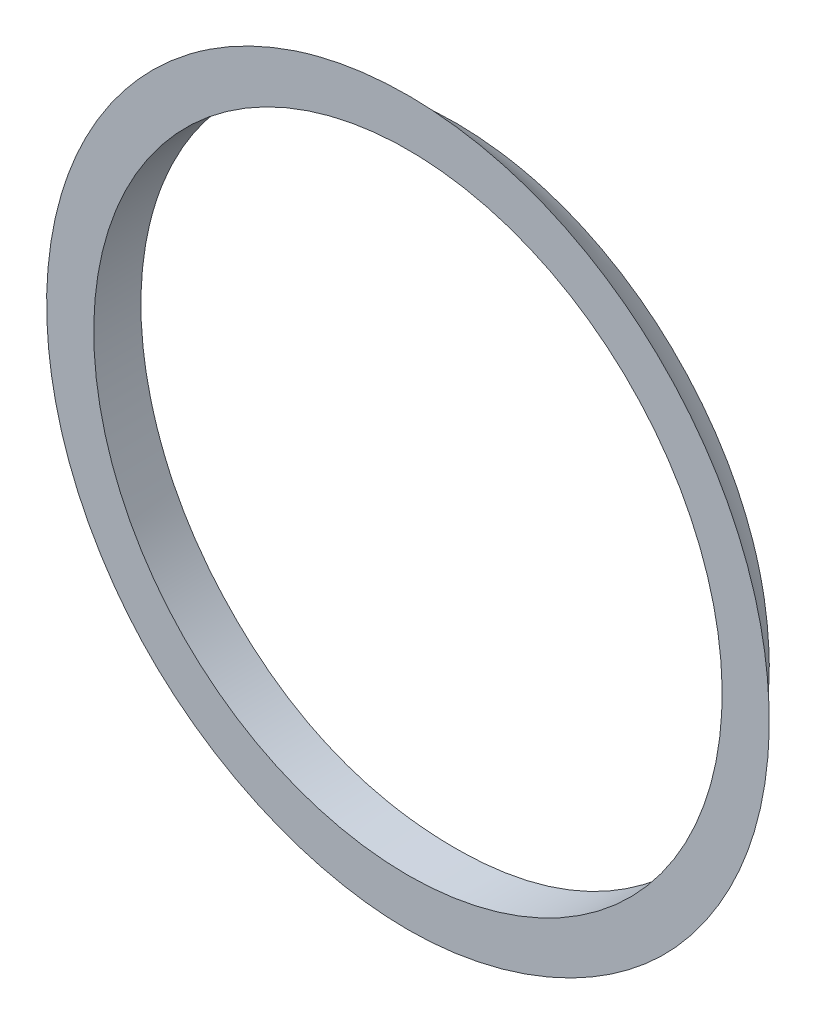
ISO-10303-21;
HEADER;
FILE_DESCRIPTION(('STEP AP214'),'2;1');
FILE_NAME('part.step','',(''),(''),'','','');
FILE_SCHEMA(('AUTOMOTIVE_DESIGN { 1 0 10303 214 1 1 1 1 }'));
ENDSEC;
DATA;
#1=APPLICATION_CONTEXT('core data for automotive mechanical design processes');
#2=APPLICATION_PROTOCOL_DEFINITION('international standard','automotive_design',2000,#1);
#3=PRODUCT_CONTEXT('',#1,'mechanical');
#4=PRODUCT('Part','Part','',(#3));
#5=PRODUCT_RELATED_PRODUCT_CATEGORY('part','',(#4));
#6=PRODUCT_DEFINITION_FORMATION('','',#4);
#7=PRODUCT_DEFINITION_CONTEXT('part definition',#1,'design');
#8=PRODUCT_DEFINITION('design','',#6,#7);
#9=PRODUCT_DEFINITION_SHAPE('','',#8);
#10=(LENGTH_UNIT() NAMED_UNIT(*) SI_UNIT(.MILLI.,.METRE.));
#11=(NAMED_UNIT(*) PLANE_ANGLE_UNIT() SI_UNIT($,.RADIAN.));
#12=(NAMED_UNIT(*) SI_UNIT($,.STERADIAN.) SOLID_ANGLE_UNIT());
#13=UNCERTAINTY_MEASURE_WITH_UNIT(LENGTH_MEASURE(1.E-05),#10,'distance_accuracy_value','');
#14=(GEOMETRIC_REPRESENTATION_CONTEXT(3) GLOBAL_UNCERTAINTY_ASSIGNED_CONTEXT((#13)) GLOBAL_UNIT_ASSIGNED_CONTEXT((#10,
#11,#12)) REPRESENTATION_CONTEXT('',''));
#15=CARTESIAN_POINT('',(0.,0.,0.));
#16=DIRECTION('',(0.,0.,1.));
#17=DIRECTION('',(1.,0.,0.));
#18=AXIS2_PLACEMENT_3D('',#15,#16,#17);
#19=CARTESIAN_POINT('',(718.031944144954,689.142048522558,-152.499999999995));
#20=DIRECTION('',(0.,0.,0.999999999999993));
#21=DIRECTION('',(0.0973225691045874,0.995252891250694,0.));
#22=AXIS2_PLACEMENT_3D('',#19,#20,#21);
#23=CYLINDRICAL_SURFACE('',#22,20.);
#24=CARTESIAN_POINT('',(718.031944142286,669.142048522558,-150.499999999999));
#25=CARTESIAN_POINT('',(717.47101142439,669.142052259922,-150.500001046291));
#26=CARTESIAN_POINT('',(716.909974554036,669.165667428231,-150.496684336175));
#27=CARTESIAN_POINT('',(715.791804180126,669.259977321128,-150.486761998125));
#28=CARTESIAN_POINT('',(715.234671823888,669.330685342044,-150.480155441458));
#29=CARTESIAN_POINT('',(714.127708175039,669.518784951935,-150.466517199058));
#30=CARTESIAN_POINT('',(713.577885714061,669.636228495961,-150.459485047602));
#31=CARTESIAN_POINT('',(712.490054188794,669.916989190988,-150.447181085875));
#32=CARTESIAN_POINT('',(711.952044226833,670.080302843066,-150.441909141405));
#33=CARTESIAN_POINT('',(711.068347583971,670.389748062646,-150.435716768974));
#34=CARTESIAN_POINT('',(710.71827380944,670.523493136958,-150.433931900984));
#35=CARTESIAN_POINT('',(710.026156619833,670.81044543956,-150.431934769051));
#36=CARTESIAN_POINT('',(709.684113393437,670.963653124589,-150.43172254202));
#37=CARTESIAN_POINT('',(709.009181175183,671.289034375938,-150.432906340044));
#38=CARTESIAN_POINT('',(708.676292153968,671.461207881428,-150.43430235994));
#39=CARTESIAN_POINT('',(708.020786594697,671.82393649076,-150.438559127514));
#40=CARTESIAN_POINT('',(707.698167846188,672.014487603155,-150.441419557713));
#41=CARTESIAN_POINT('',(707.064147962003,672.413398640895,-150.448283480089));
#42=CARTESIAN_POINT('',(706.752746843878,672.621758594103,-150.452286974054));
#43=CARTESIAN_POINT('',(706.142139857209,673.055631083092,-150.46092886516));
#44=CARTESIAN_POINT('',(705.842934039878,673.281143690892,-150.465567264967));
#45=CARTESIAN_POINT('',(705.257897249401,673.74842111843,-150.474774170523));
#46=CARTESIAN_POINT('',(704.972055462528,673.990172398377,-150.479342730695));
#47=CARTESIAN_POINT('',(704.414378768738,674.489336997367,-150.487525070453));
#48=CARTESIAN_POINT('',(704.142543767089,674.746750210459,-150.491138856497));
#49=CARTESIAN_POINT('',(703.613736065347,675.276432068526,-150.496329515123));
#50=CARTESIAN_POINT('',(703.356763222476,675.548700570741,-150.497906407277));
#51=CARTESIAN_POINT('',(702.858494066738,676.107230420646,-150.499570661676));
#52=CARTESIAN_POINT('',(702.617198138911,676.39349211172,-150.49965798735));
#53=CARTESIAN_POINT('',(702.151034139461,676.979123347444,-150.499146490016));
#54=CARTESIAN_POINT('',(701.926166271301,677.278493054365,-150.498547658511));
#55=CARTESIAN_POINT('',(701.6017514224,677.736620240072,-150.497900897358));
#56=CARTESIAN_POINT('',(701.495757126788,677.890847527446,-150.49772722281));
#57=CARTESIAN_POINT('',(701.288135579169,678.202217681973,-150.497582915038));
#58=CARTESIAN_POINT('',(701.186508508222,678.359360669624,-150.497612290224));
#59=CARTESIAN_POINT('',(700.788682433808,678.9938760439,-150.498076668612));
#60=CARTESIAN_POINT('',(700.510240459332,679.482564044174,-150.499205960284));
#61=CARTESIAN_POINT('',(699.995511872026,680.481626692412,-150.502113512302));
#62=CARTESIAN_POINT('',(699.759225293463,680.992001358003,-150.503891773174));
#63=CARTESIAN_POINT('',(699.437676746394,681.771010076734,-150.50601073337));
#64=CARTESIAN_POINT('',(699.335964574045,682.032950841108,-150.506625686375));
#65=CARTESIAN_POINT('',(699.143661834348,682.560884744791,-150.50753036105));
#66=CARTESIAN_POINT('',(699.053071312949,682.826877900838,-150.507820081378));
#67=CARTESIAN_POINT('',(698.798248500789,683.630200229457,-150.50808594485));
#68=CARTESIAN_POINT('',(698.650916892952,684.172988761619,-150.507459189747));
#69=CARTESIAN_POINT('',(698.402412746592,685.269371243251,-150.505003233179));
#70=CARTESIAN_POINT('',(698.301267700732,685.82297142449,-150.503173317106));
#71=CARTESIAN_POINT('',(698.184794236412,686.658152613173,-150.501275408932));
#72=CARTESIAN_POINT('',(698.15184206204,686.937374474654,-150.500783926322));
#73=CARTESIAN_POINT('',(698.097734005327,687.49697683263,-150.500125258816));
#74=CARTESIAN_POINT('',(698.076578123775,687.777357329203,-150.49995807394));
#75=CARTESIAN_POINT('',(698.046105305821,688.338755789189,-150.499869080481));
#76=CARTESIAN_POINT('',(698.036788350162,688.619773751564,-150.499947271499));
#77=CARTESIAN_POINT('',(698.030008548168,689.181953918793,-150.499998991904));
#78=CARTESIAN_POINT('',(698.032545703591,689.463116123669,-150.499972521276));
#79=CARTESIAN_POINT('',(698.049469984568,690.025083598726,-150.49996992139));
#80=CARTESIAN_POINT('',(698.063857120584,690.305888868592,-150.499993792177));
#81=CARTESIAN_POINT('',(698.104455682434,690.866643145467,-150.500332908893));
#82=CARTESIAN_POINT('',(698.130667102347,691.146592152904,-150.500648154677));
#83=CARTESIAN_POINT('',(698.194868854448,691.705146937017,-150.501581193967));
#84=CARTESIAN_POINT('',(698.232859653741,691.98375265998,-150.502198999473));
#85=CARTESIAN_POINT('',(698.320552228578,692.53911462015,-150.503601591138));
#86=CARTESIAN_POINT('',(698.3702540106,692.815870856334,-150.50438637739));
#87=CARTESIAN_POINT('',(698.481280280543,693.367042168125,-150.505759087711));
#88=CARTESIAN_POINT('',(698.542604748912,693.64145724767,-150.506347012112));
#89=CARTESIAN_POINT('',(698.676767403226,694.187458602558,-150.507186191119));
#90=CARTESIAN_POINT('',(698.749605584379,694.459044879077,-150.507437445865));
#91=CARTESIAN_POINT('',(698.906666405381,694.998906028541,-150.507588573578));
#92=CARTESIAN_POINT('',(698.990889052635,695.267180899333,-150.507488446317));
#93=CARTESIAN_POINT('',(699.170568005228,695.799940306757,-150.50698581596));
#94=CARTESIAN_POINT('',(699.266024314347,696.064424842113,-150.506583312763));
#95=CARTESIAN_POINT('',(699.468004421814,696.589139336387,-150.505615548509));
#96=CARTESIAN_POINT('',(699.574528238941,696.849369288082,-150.505050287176));
#97=CARTESIAN_POINT('',(699.798441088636,697.365090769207,-150.503920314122));
#98=CARTESIAN_POINT('',(699.915830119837,697.620582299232,-150.5033556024));
#99=CARTESIAN_POINT('',(700.284000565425,698.379275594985,-150.50169535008));
#100=CARTESIAN_POINT('',(700.550829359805,698.874810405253,-150.500633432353));
#101=CARTESIAN_POINT('',(701.125246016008,699.841572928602,-150.498634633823));
#102=CARTESIAN_POINT('',(701.432833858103,700.312800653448,-150.497697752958));
#103=CARTESIAN_POINT('',(702.086620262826,701.22768916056,-150.495925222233));
#104=CARTESIAN_POINT('',(702.432818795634,701.671349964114,-150.495089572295));
#105=CARTESIAN_POINT('',(703.161356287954,702.527927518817,-150.493922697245));
#106=CARTESIAN_POINT('',(703.543695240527,702.940844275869,-150.493591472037));
#107=CARTESIAN_POINT('',(704.341813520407,703.733020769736,-150.493650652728));
#108=CARTESIAN_POINT('',(704.757594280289,704.112279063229,-150.494041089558));
#109=CARTESIAN_POINT('',(705.619631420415,704.834423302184,-150.495292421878));
#110=CARTESIAN_POINT('',(706.065887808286,705.177309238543,-150.496153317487));
#111=CARTESIAN_POINT('',(706.985680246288,705.824261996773,-150.49795220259));
#112=CARTESIAN_POINT('',(707.459216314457,706.128328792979,-150.498890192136));
#113=CARTESIAN_POINT('',(708.430291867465,706.695519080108,-150.50090491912));
#114=CARTESIAN_POINT('',(708.927831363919,706.958642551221,-150.501981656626));
#115=CARTESIAN_POINT('',(709.689294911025,707.321139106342,-150.503655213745));
#116=CARTESIAN_POINT('',(709.945671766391,707.436617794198,-150.50422287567));
#117=CARTESIAN_POINT('',(710.463082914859,707.656673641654,-150.505344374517));
#118=CARTESIAN_POINT('',(710.724117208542,707.761250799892,-150.505898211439));
#119=CARTESIAN_POINT('',(711.250358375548,707.959305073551,-150.506808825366));
#120=CARTESIAN_POINT('',(711.515565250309,708.052782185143,-150.507165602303));
#121=CARTESIAN_POINT('',(712.049684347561,708.228473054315,-150.507561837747));
#122=CARTESIAN_POINT('',(712.318596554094,708.310686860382,-150.50760129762));
#123=CARTESIAN_POINT('',(712.859647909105,708.463704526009,-150.507327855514));
#124=CARTESIAN_POINT('',(713.131787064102,708.534508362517,-150.507014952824));
#125=CARTESIAN_POINT('',(713.678808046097,708.664580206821,-150.506054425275));
#126=CARTESIAN_POINT('',(713.953689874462,708.723848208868,-150.50540680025));
#127=CARTESIAN_POINT('',(714.505707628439,708.830743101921,-150.503976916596));
#128=CARTESIAN_POINT('',(714.782843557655,708.878369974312,-150.503194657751));
#129=CARTESIAN_POINT('',(715.338877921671,708.961897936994,-150.501838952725));
#130=CARTESIAN_POINT('',(715.617776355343,708.997799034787,-150.50126550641));
#131=CARTESIAN_POINT('',(716.176824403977,709.057810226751,-150.500434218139));
#132=CARTESIAN_POINT('',(716.456973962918,709.081920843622,-150.500176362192));
#133=CARTESIAN_POINT('',(717.01804987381,709.118310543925,-150.499925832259));
#134=CARTESIAN_POINT('',(717.298976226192,709.130589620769,-150.499933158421));
#135=CARTESIAN_POINT('',(717.720548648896,709.140118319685,-150.499977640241));
#136=CARTESIAN_POINT('',(717.86110713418,709.141812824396,-150.499998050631));
#137=CARTESIAN_POINT('',(718.142228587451,709.142238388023,-150.500001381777));
#138=CARTESIAN_POINT('',(718.282791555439,709.140969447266,-150.499984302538));
#139=CARTESIAN_POINT('',(718.70439057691,709.132717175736,-150.499939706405));
#140=CARTESIAN_POINT('',(718.985352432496,709.121288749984,-150.499918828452));
#141=CARTESIAN_POINT('',(719.546535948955,709.086597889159,-150.500133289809));
#142=CARTESIAN_POINT('',(719.826757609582,709.063335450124,-150.500368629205));
#143=CARTESIAN_POINT('',(720.385971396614,709.005018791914,-150.501156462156));
#144=CARTESIAN_POINT('',(720.664963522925,708.969964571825,-150.501708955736));
#145=CARTESIAN_POINT('',(721.221227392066,708.888123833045,-150.503036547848));
#146=CARTESIAN_POINT('',(721.498499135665,708.841337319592,-150.50381164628));
#147=CARTESIAN_POINT('',(722.05079911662,708.736126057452,-150.505257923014));
#148=CARTESIAN_POINT('',(722.325827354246,708.677701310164,-150.505929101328));
#149=CARTESIAN_POINT('',(723.146874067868,708.485091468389,-150.507430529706));
#150=CARTESIAN_POINT('',(723.688975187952,708.333553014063,-150.507749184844));
#151=CARTESIAN_POINT('',(724.490893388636,708.072477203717,-150.507231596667));
#152=CARTESIAN_POINT('',(724.756356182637,707.979811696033,-150.506893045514));
#153=CARTESIAN_POINT('',(725.283147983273,707.783374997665,-150.506007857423));
#154=CARTESIAN_POINT('',(725.544476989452,707.679603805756,-150.505461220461));
#155=CARTESIAN_POINT('',(726.32152638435,707.351901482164,-150.503791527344));
#156=CARTESIAN_POINT('',(726.830428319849,707.111542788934,-150.502638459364));
#157=CARTESIAN_POINT('',(727.826110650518,706.588840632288,-150.500496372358));
#158=CARTESIAN_POINT('',(728.312891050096,706.30649717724,-150.499507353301));
#159=CARTESIAN_POINT('',(729.260941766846,705.701809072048,-150.497584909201));
#160=CARTESIAN_POINT('',(729.722212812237,705.379465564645,-150.496651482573));
#161=CARTESIAN_POINT('',(730.615958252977,704.697070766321,-150.495027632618));
#162=CARTESIAN_POINT('',(731.048432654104,704.337019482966,-150.494337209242));
#163=CARTESIAN_POINT('',(731.881516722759,703.581766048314,-150.493586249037));
#164=CARTESIAN_POINT('',(732.282126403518,703.18656391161,-150.493525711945));
#165=CARTESIAN_POINT('',(733.048631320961,702.363819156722,-150.494075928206));
#166=CARTESIAN_POINT('',(733.414526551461,701.936276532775,-150.494686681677));
#167=CARTESIAN_POINT('',(734.109015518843,701.051872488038,-150.496221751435));
#168=CARTESIAN_POINT('',(734.43760782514,700.595009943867,-150.497146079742));
#169=CARTESIAN_POINT('',(735.05513880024,699.655229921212,-150.499039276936));
#170=CARTESIAN_POINT('',(735.344077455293,699.172312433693,-150.500008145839));
#171=CARTESIAN_POINT('',(735.880247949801,698.183849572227,-150.502102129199));
#172=CARTESIAN_POINT('',(736.127479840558,697.678304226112,-150.503227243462));
#173=CARTESIAN_POINT('',(736.578474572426,696.648205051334,-150.505499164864));
#174=CARTESIAN_POINT('',(736.782237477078,696.123651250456,-150.506645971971));
#175=CARTESIAN_POINT('',(737.14487295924,695.059143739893,-150.507714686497));
#176=CARTESIAN_POINT('',(737.303743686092,694.519189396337,-150.507636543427));
#177=CARTESIAN_POINT('',(737.507487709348,693.700813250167,-150.506463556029));
#178=CARTESIAN_POINT('',(737.569647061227,693.426582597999,-150.505896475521));
#179=CARTESIAN_POINT('',(737.682355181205,692.875726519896,-150.504546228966));
#180=CARTESIAN_POINT('',(737.73290394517,692.599101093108,-150.503763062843));
#181=CARTESIAN_POINT('',(737.822292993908,692.043969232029,-150.50234260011));
#182=CARTESIAN_POINT('',(737.861133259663,691.765462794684,-150.501705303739));
#183=CARTESIAN_POINT('',(737.927038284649,691.207058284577,-150.500730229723));
#184=CARTESIAN_POINT('',(737.954103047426,690.927160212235,-150.500392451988));
#185=CARTESIAN_POINT('',(737.996408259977,690.36647238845,-150.500012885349));
#186=CARTESIAN_POINT('',(738.011648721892,690.085682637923,-150.499971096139));
#187=CARTESIAN_POINT('',(738.030278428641,689.523710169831,-150.499967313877));
#188=CARTESIAN_POINT('',(738.033667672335,689.242527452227,-150.500005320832));
#189=CARTESIAN_POINT('',(738.028588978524,688.680282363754,-150.49995894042));
#190=CARTESIAN_POINT('',(738.020121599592,688.399219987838,-150.499874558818));
#191=CARTESIAN_POINT('',(737.991345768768,687.837701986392,-150.499934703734));
#192=CARTESIAN_POINT('',(737.971037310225,687.557246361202,-150.500079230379));
#193=CARTESIAN_POINT('',(737.918615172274,686.997439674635,-150.500693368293));
#194=CARTESIAN_POINT('',(737.886501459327,686.718088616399,-150.501162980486));
#195=CARTESIAN_POINT('',(737.810526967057,686.160991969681,-150.502386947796));
#196=CARTESIAN_POINT('',(737.766666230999,685.88324637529,-150.503141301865));
#197=CARTESIAN_POINT('',(737.667272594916,685.329845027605,-150.504676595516));
#198=CARTESIAN_POINT('',(737.611739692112,685.054189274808,-150.505457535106));
#199=CARTESIAN_POINT('',(737.489110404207,684.505481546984,-150.506737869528));
#200=CARTESIAN_POINT('',(737.422013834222,684.232429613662,-150.507237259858));
#201=CARTESIAN_POINT('',(737.203530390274,683.417879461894,-150.508163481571));
#202=CARTESIAN_POINT('',(737.034926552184,682.880857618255,-150.508018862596));
#203=CARTESIAN_POINT('',(736.716791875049,681.999419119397,-150.506603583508));
#204=CARTESIAN_POINT('',(736.579627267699,681.650452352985,-150.505724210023));
#205=CARTESIAN_POINT('',(736.285893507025,680.960743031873,-150.503723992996));
#206=CARTESIAN_POINT('',(736.129324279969,680.620000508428,-150.502603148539));
#207=CARTESIAN_POINT('',(735.797291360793,679.947867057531,-150.500531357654));
#208=CARTESIAN_POINT('',(735.621827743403,679.616476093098,-150.499580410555));
#209=CARTESIAN_POINT('',(735.25254969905,678.964071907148,-150.498172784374));
#210=CARTESIAN_POINT('',(735.058736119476,678.643058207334,-150.497716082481));
#211=CARTESIAN_POINT('',(734.754741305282,678.170120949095,-150.497591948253));
#212=CARTESIAN_POINT('',(734.651191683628,678.01389801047,-150.497644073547));
#213=CARTESIAN_POINT('',(734.439742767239,677.704423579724,-150.497925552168));
#214=CARTESIAN_POINT('',(734.33184347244,677.551172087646,-150.498154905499));
#215=CARTESIAN_POINT('',(734.001752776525,677.096067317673,-150.498880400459));
#216=CARTESIAN_POINT('',(733.77314794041,676.79883166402,-150.499414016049));
#217=CARTESIAN_POINT('',(733.29959276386,676.217676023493,-150.49961117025));
#218=CARTESIAN_POINT('',(733.054642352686,675.933756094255,-150.499274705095));
#219=CARTESIAN_POINT('',(732.675570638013,675.518563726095,-150.497559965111));
#220=CARTESIAN_POINT('',(732.547265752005,675.381941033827,-150.496786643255));
#221=CARTESIAN_POINT('',(732.286869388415,675.112357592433,-150.494751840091));
#222=CARTESIAN_POINT('',(732.154777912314,674.979396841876,-150.493490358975));
#223=CARTESIAN_POINT('',(731.752981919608,674.586171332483,-150.489012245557));
#224=CARTESIAN_POINT('',(731.477732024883,674.331537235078,-150.485101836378));
#225=CARTESIAN_POINT('',(730.91331514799,673.838099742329,-150.47653583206));
#226=CARTESIAN_POINT('',(730.624144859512,673.599300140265,-150.471880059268));
#227=CARTESIAN_POINT('',(730.032835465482,673.138326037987,-150.46266256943));
#228=CARTESIAN_POINT('',(729.730696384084,672.916151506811,-150.458100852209));
#229=CARTESIAN_POINT('',(729.114408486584,672.489135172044,-150.449737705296));
#230=CARTESIAN_POINT('',(728.800259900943,672.284293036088,-150.445936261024));
#231=CARTESIAN_POINT('',(728.160982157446,671.892611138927,-150.439562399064));
#232=CARTESIAN_POINT('',(727.835854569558,671.705768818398,-150.436989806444));
#233=CARTESIAN_POINT('',(727.17559872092,671.350643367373,-150.43335682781));
#234=CARTESIAN_POINT('',(726.840470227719,671.182360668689,-150.432296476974));
#235=CARTESIAN_POINT('',(726.161263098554,670.864884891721,-150.431792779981));
#236=CARTESIAN_POINT('',(725.817183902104,670.71569301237,-150.432349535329));
#237=CARTESIAN_POINT('',(725.121565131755,670.437035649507,-150.435010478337));
#238=CARTESIAN_POINT('',(724.770034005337,670.307549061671,-150.437112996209));
#239=CARTESIAN_POINT('',(724.060291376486,670.06852661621,-150.442626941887));
#240=CARTESIAN_POINT('',(723.702080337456,669.958989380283,-150.446038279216));
#241=CARTESIAN_POINT('',(722.980179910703,669.760224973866,-150.453768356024));
#242=CARTESIAN_POINT('',(722.61649204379,669.670992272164,-150.458086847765));
#243=CARTESIAN_POINT('',(721.904372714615,669.517325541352,-150.466829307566));
#244=CARTESIAN_POINT('',(721.556172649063,669.451815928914,-150.471235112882));
#245=CARTESIAN_POINT('',(720.856725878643,669.339369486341,-150.479758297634));
#246=CARTESIAN_POINT('',(720.505478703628,669.292435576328,-150.483875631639));
#247=CARTESIAN_POINT('',(719.801033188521,669.217296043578,-150.491112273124));
#248=CARTESIAN_POINT('',(719.447835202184,669.189087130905,-150.494231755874));
#249=CARTESIAN_POINT('',(718.740420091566,669.151461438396,-150.498675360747));
#250=CARTESIAN_POINT('',(718.386202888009,669.142046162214,-150.499999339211));
#251=CARTESIAN_POINT('',(718.031944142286,669.142048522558,-150.499999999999));
#252=B_SPLINE_CURVE_WITH_KNOTS('',3,(#24,#25,#26,#27,#28,#29,#30,#31,#32,#33,#34,#35,#36,#37,
#38,#39,#40,#41,#42,#43,#44,#45,#46,#47,#48,#49,#50,#51,#52,#53,#54,#55,#56,#57,#58,#59,#60,#61,
#62,#63,#64,#65,#66,#67,#68,#69,#70,#71,#72,#73,#74,#75,#76,#77,#78,#79,#80,#81,#82,#83,#84,#85,
#86,#87,#88,#89,#90,#91,#92,#93,#94,#95,#96,#97,#98,#99,#100,#101,#102,#103,#104,#105,#106,#107,
#108,#109,#110,#111,#112,#113,#114,#115,#116,#117,#118,#119,#120,#121,#122,#123,#124,#125,#126,
#127,#128,#129,#130,#131,#132,#133,#134,#135,#136,#137,#138,#139,#140,#141,#142,#143,#144,#145,
#146,#147,#148,#149,#150,#151,#152,#153,#154,#155,#156,#157,#158,#159,#160,#161,#162,#163,#164,
#165,#166,#167,#168,#169,#170,#171,#172,#173,#174,#175,#176,#177,#178,#179,#180,#181,#182,#183,
#184,#185,#186,#187,#188,#189,#190,#191,#192,#193,#194,#195,#196,#197,#198,#199,#200,#201,#202,
#203,#204,#205,#206,#207,#208,#209,#210,#211,#212,#213,#214,#215,#216,#217,#218,#219,#220,#221,
#222,#223,#224,#225,#226,#227,#228,#229,#230,#231,#232,#233,#234,#235,#236,#237,#238,#239,#240,
#241,#242,#243,#244,#245,#246,#247,#248,#249,#250,#251),.UNSPECIFIED.,.T.,.F.,(4,2,2,2,2,2,2,2,
2,2,2,2,2,2,2,2,2,2,2,2,2,2,2,2,2,2,2,2,2,2,2,2,2,2,2,2,2,2,2,2,2,2,2,2,2,2,2,2,2,2,2,2,2,2,2,2,
2,2,2,2,2,2,2,2,2,2,2,2,2,2,2,2,2,2,2,2,2,2,2,2,2,2,2,2,2,2,2,2,2,2,2,2,2,2,2,2,2,2,2,2,2,2,2,2,
2,2,2,2,2,2,2,2,2,4),(0.,1.68248513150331,3.36544550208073,5.05028203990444,6.73499009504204,
7.85871906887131,8.98247441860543,10.1062261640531,11.2297343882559,12.3532443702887,
13.476759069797,14.5993483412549,15.7219300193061,16.8445009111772,17.9670993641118,
19.0897117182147,19.651061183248,20.2124338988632,21.8975910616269,23.5827495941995,
24.4255175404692,25.2682889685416,26.9534549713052,28.6396227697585,29.4828942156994,
30.3261657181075,31.169435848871,32.0127061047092,32.8559771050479,33.6992476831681,
34.5425517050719,35.3858561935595,36.2291592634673,37.0724619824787,37.9157652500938,
38.7590688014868,39.602373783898,40.4456786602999,42.1319220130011,43.8181645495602,
45.5044057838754,47.1906466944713,48.876959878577,50.5632734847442,52.2495882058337,
53.9359037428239,54.779252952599,55.6226022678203,56.4659518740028,57.3092978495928,
58.1526455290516,58.9959936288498,59.8393430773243,60.6826919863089,61.5260035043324,
62.3693154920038,62.7909946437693,63.2126737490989,64.0559849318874,64.899296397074,
65.7426079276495,66.5859190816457,67.4292301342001,69.1154875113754,69.9588042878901,
70.8021211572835,72.488380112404,74.1746387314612,75.8608491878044,77.5470593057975,
79.2332687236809,80.9194784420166,82.6057528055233,84.2920277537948,85.9783006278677,
87.6645710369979,89.3509109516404,90.1942697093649,91.0376287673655,91.8809891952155,
92.7243493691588,93.5677086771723,94.4110680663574,95.2543877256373,96.0977078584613,
96.941030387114,97.7843498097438,98.6276694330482,99.4710025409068,101.157275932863,
102.28163640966,103.406001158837,104.530361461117,105.654669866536,106.216881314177,
106.779092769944,107.903401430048,109.027714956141,109.589927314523,110.152139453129,
111.276457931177,112.401044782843,113.525629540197,114.650192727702,115.774595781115,
116.899024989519,118.023524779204,119.146811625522,120.270020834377,121.392923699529,
122.455437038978,123.518117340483,124.580610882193,125.643189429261),.UNSPECIFIED.);
#253=CARTESIAN_POINT('',(718.031944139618,669.142048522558,-150.5));
#254=VERTEX_POINT('',#253);
#255=EDGE_CURVE('E61',#254,#254,#252,.T.);
#256=ORIENTED_EDGE('',*,*,#255,.T.);
#257=EDGE_LOOP('',(#256));
#258=FACE_BOUND('',#257,.T.);
#259=CARTESIAN_POINT('',(718.031944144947,689.142048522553,-147.499999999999));
#260=DIRECTION('',(0.,0.,-1.));
#261=DIRECTION('',(-0.452439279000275,0.891795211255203,0.));
#262=AXIS2_PLACEMENT_3D('',#259,#260,#261);
#263=CIRCLE('',#262,20.0000000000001);
#264=CARTESIAN_POINT('',(708.983158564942,706.977952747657,-147.499999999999));
#265=VERTEX_POINT('',#264);
#266=EDGE_CURVE('E71',#265,#265,#263,.T.);
#267=ORIENTED_EDGE('',*,*,#266,.F.);
#268=EDGE_LOOP('',(#267));
#269=FACE_BOUND('',#268,.T.);
#270=ADVANCED_FACE('F54',(#258,#269),#23,.F.);
#271=CARTESIAN_POINT('',(731.147205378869,740.649231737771,-147.499999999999));
#272=DIRECTION('',(0.,0.,1.));
#273=DIRECTION('',(0.452439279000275,-0.891795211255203,0.));
#274=AXIS2_PLACEMENT_3D('',#271,#272,#273);
#275=PLANE('',#274);
#276=CARTESIAN_POINT('',(718.031944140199,666.142048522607,-147.499999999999));
#277=CARTESIAN_POINT('',(718.654473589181,666.142041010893,-147.499999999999));
#278=CARTESIAN_POINT('',(719.276883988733,666.169511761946,-147.499999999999));
#279=CARTESIAN_POINT('',(720.517334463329,666.277097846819,-147.499999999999));
#280=CARTESIAN_POINT('',(721.135373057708,666.357230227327,-147.499999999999));
#281=CARTESIAN_POINT('',(722.364072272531,666.568034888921,-147.499999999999));
#282=CARTESIAN_POINT('',(722.974714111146,666.698815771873,-147.499999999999));
#283=CARTESIAN_POINT('',(724.183590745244,667.008671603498,-147.499999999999));
#284=CARTESIAN_POINT('',(724.781826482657,667.187742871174,-147.499999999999));
#285=CARTESIAN_POINT('',(725.764358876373,667.524295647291,-147.499999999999));
#286=CARTESIAN_POINT('',(726.153131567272,667.668883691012,-147.499999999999));
#287=CARTESIAN_POINT('',(726.922701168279,667.977972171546,-147.499999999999));
#288=CARTESIAN_POINT('',(727.303498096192,668.142472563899,-147.499999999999));
#289=CARTESIAN_POINT('',(728.056096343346,668.490895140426,-147.499999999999));
#290=CARTESIAN_POINT('',(728.427897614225,668.674817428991,-147.499999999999));
#291=CARTESIAN_POINT('',(729.161082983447,669.061431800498,-147.499999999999));
#292=CARTESIAN_POINT('',(729.522478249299,669.264102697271,-147.499999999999));
#293=CARTESIAN_POINT('',(730.23423116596,669.687991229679,-147.499999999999));
#294=CARTESIAN_POINT('',(730.584588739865,669.909208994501,-147.499999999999));
#295=CARTESIAN_POINT('',(731.273189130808,670.369842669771,-147.499999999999));
#296=CARTESIAN_POINT('',(731.61143063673,670.609260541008,-147.499999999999));
#297=CARTESIAN_POINT('',(732.301717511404,671.126244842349,-147.499999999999));
#298=CARTESIAN_POINT('',(732.652627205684,671.405329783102,-147.499999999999));
#299=CARTESIAN_POINT('',(733.337252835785,671.983913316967,-147.499999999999));
#300=CARTESIAN_POINT('',(733.670968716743,672.28341197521,-147.499999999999));
#301=CARTESIAN_POINT('',(734.157238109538,672.747533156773,-147.499999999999));
#302=CARTESIAN_POINT('',(734.31694310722,672.904718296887,-147.499999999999));
#303=CARTESIAN_POINT('',(734.631412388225,673.22395521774,-147.499999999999));
#304=CARTESIAN_POINT('',(734.786176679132,673.386006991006,-147.499999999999));
#305=CARTESIAN_POINT('',(735.243043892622,673.879309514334,-147.499999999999));
#306=CARTESIAN_POINT('',(735.537604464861,674.217596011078,-147.499999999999));
#307=CARTESIAN_POINT('',(736.105928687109,674.911277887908,-147.499999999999));
#308=CARTESIAN_POINT('',(736.379688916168,675.266676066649,-147.499999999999));
#309=CARTESIAN_POINT('',(736.774407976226,675.81124078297,-147.499999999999));
#310=CARTESIAN_POINT('',(736.903332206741,675.994681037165,-147.499999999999));
#311=CARTESIAN_POINT('',(737.15590307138,676.365212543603,-147.499999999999));
#312=CARTESIAN_POINT('',(737.279548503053,676.552304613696,-147.499999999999));
#313=CARTESIAN_POINT('',(737.741565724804,677.273645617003,-147.499999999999));
#314=CARTESIAN_POINT('',(738.06123168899,677.82007475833,-147.499999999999));
#315=CARTESIAN_POINT('',(738.654915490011,678.937153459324,-147.499999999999));
#316=CARTESIAN_POINT('',(738.92893060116,679.507804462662,-147.499999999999));
#317=CARTESIAN_POINT('',(739.428587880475,680.669665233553,-147.499999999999));
#318=CARTESIAN_POINT('',(739.654249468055,681.260866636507,-147.499999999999));
#319=CARTESIAN_POINT('',(740.055105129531,682.460266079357,-147.499999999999));
#320=CARTESIAN_POINT('',(740.230296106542,683.068465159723,-147.499999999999));
#321=CARTESIAN_POINT('',(740.455748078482,683.995704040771,-147.499999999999));
#322=CARTESIAN_POINT('',(740.525132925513,684.310216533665,-147.499999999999));
#323=CARTESIAN_POINT('',(740.650539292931,684.94191195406,-147.499999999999));
#324=CARTESIAN_POINT('',(740.70656088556,685.259094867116,-147.499999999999));
#325=CARTESIAN_POINT('',(740.805374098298,685.895514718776,-147.499999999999));
#326=CARTESIAN_POINT('',(740.848165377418,686.214751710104,-147.499999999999));
#327=CARTESIAN_POINT('',(740.920531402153,686.854723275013,-147.499999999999));
#328=CARTESIAN_POINT('',(740.95010606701,687.175457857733,-147.499999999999));
#329=CARTESIAN_POINT('',(740.995980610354,687.817990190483,-147.499999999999));
#330=CARTESIAN_POINT('',(741.012275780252,688.139788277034,-147.499999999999));
#331=CARTESIAN_POINT('',(741.031369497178,688.78378179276,-147.499999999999));
#332=CARTESIAN_POINT('',(741.034168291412,689.10597721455,-147.499999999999));
#333=CARTESIAN_POINT('',(741.026156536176,689.750200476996,-147.499999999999));
#334=CARTESIAN_POINT('',(741.015345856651,690.07222831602,-147.499999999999));
#335=CARTESIAN_POINT('',(740.980372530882,690.715563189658,-147.499999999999));
#336=CARTESIAN_POINT('',(740.956209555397,691.036870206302,-147.499999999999));
#337=CARTESIAN_POINT('',(740.894325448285,691.681321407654,-147.499999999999));
#338=CARTESIAN_POINT('',(740.856475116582,692.004453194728,-147.499999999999));
#339=CARTESIAN_POINT('',(740.767282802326,692.648845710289,-147.499999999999));
#340=CARTESIAN_POINT('',(740.715941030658,692.970106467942,-147.499999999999));
#341=CARTESIAN_POINT('',(740.59965466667,693.610143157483,-147.499999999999));
#342=CARTESIAN_POINT('',(740.534710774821,693.92891921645,-147.499999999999));
#343=CARTESIAN_POINT('',(740.391142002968,694.563381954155,-147.499999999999));
#344=CARTESIAN_POINT('',(740.312516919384,694.879068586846,-147.499999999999));
#345=CARTESIAN_POINT('',(740.141741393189,695.506648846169,-147.499999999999));
#346=CARTESIAN_POINT('',(740.049595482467,695.818543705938,-147.499999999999));
#347=CARTESIAN_POINT('',(739.85194214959,696.438070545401,-147.499999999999));
#348=CARTESIAN_POINT('',(739.746434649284,696.745702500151,-147.499999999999));
#349=CARTESIAN_POINT('',(739.522324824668,697.35613870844,-147.499999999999));
#350=CARTESIAN_POINT('',(739.403723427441,697.658943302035,-147.499999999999));
#351=CARTESIAN_POINT('',(739.153744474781,698.259296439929,-147.499999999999));
#352=CARTESIAN_POINT('',(739.022363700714,698.556843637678,-147.499999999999));
#353=CARTESIAN_POINT('',(738.612739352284,699.433748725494,-147.499999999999));
#354=CARTESIAN_POINT('',(738.316300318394,700.004738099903,-147.499999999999));
#355=CARTESIAN_POINT('',(737.676773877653,701.119874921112,-147.499999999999));
#356=CARTESIAN_POINT('',(737.333685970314,701.664022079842,-147.499999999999));
#357=CARTESIAN_POINT('',(736.603057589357,702.721877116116,-147.499999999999));
#358=CARTESIAN_POINT('',(736.215503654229,703.235575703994,-147.499999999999));
#359=CARTESIAN_POINT('',(735.398934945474,704.228906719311,-147.499999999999));
#360=CARTESIAN_POINT('',(734.96991832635,704.708537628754,-147.499999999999));
#361=CARTESIAN_POINT('',(734.069523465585,705.634676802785,-147.499999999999));
#362=CARTESIAN_POINT('',(733.597799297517,706.080848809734,-147.499999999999));
#363=CARTESIAN_POINT('',(732.618571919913,706.932018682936,-147.499999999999));
#364=CARTESIAN_POINT('',(732.111069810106,707.337017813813,-147.499999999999));
#365=CARTESIAN_POINT('',(731.063874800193,708.102635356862,-147.499999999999));
#366=CARTESIAN_POINT('',(730.524191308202,708.463266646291,-147.499999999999));
#367=CARTESIAN_POINT('',(729.416209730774,709.13775668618,-147.499999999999));
#368=CARTESIAN_POINT('',(728.847910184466,709.4516130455,-147.499999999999));
#369=CARTESIAN_POINT('',(727.976900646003,709.885729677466,-147.499999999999));
#370=CARTESIAN_POINT('',(727.683235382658,710.024417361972,-147.499999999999));
#371=CARTESIAN_POINT('',(727.09028469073,710.289252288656,-147.499999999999));
#372=CARTESIAN_POINT('',(726.790999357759,710.415399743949,-147.499999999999));
#373=CARTESIAN_POINT('',(726.187350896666,710.654822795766,-147.499999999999));
#374=CARTESIAN_POINT('',(725.882988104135,710.768099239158,-147.499999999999));
#375=CARTESIAN_POINT('',(725.269675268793,710.981476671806,-147.499999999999));
#376=CARTESIAN_POINT('',(724.960725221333,711.08157764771,-147.499999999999));
#377=CARTESIAN_POINT('',(724.338744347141,711.268388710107,-147.499999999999));
#378=CARTESIAN_POINT('',(724.025712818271,711.355096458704,-147.499999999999));
#379=CARTESIAN_POINT('',(723.396168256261,711.514953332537,-147.499999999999));
#380=CARTESIAN_POINT('',(723.079654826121,711.588100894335,-147.499999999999));
#381=CARTESIAN_POINT('',(722.44376599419,711.720751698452,-147.499999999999));
#382=CARTESIAN_POINT('',(722.124390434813,711.780254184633,-147.499999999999));
#383=CARTESIAN_POINT('',(721.483454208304,711.885751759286,-147.499999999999));
#384=CARTESIAN_POINT('',(721.161893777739,711.931748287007,-147.499999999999));
#385=CARTESIAN_POINT('',(720.520918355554,712.009831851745,-147.499999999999));
#386=CARTESIAN_POINT('',(720.201522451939,712.042075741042,-147.499999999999));
#387=CARTESIAN_POINT('',(719.561678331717,712.093380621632,-147.499999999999));
#388=CARTESIAN_POINT('',(719.241230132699,712.112441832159,-147.499999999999));
#389=CARTESIAN_POINT('',(718.599818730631,712.137233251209,-147.499999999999));
#390=CARTESIAN_POINT('',(718.278855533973,712.142963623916,-147.499999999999));
#391=CARTESIAN_POINT('',(717.636974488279,712.140893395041,-147.499999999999));
#392=CARTESIAN_POINT('',(717.316056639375,712.133092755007,-147.499999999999));
#393=CARTESIAN_POINT('',(716.6748652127,712.104201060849,-147.499999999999));
#394=CARTESIAN_POINT('',(716.354591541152,712.083112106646,-147.499999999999));
#395=CARTESIAN_POINT('',(715.715212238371,712.027769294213,-147.499999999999));
#396=CARTESIAN_POINT('',(715.396106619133,711.993515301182,-147.499999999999));
#397=CARTESIAN_POINT('',(714.441287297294,711.871063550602,-147.499999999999));
#398=CARTESIAN_POINT('',(713.807920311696,711.763169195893,-147.499999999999));
#399=CARTESIAN_POINT('',(712.861654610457,711.560357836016,-147.499999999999));
#400=CARTESIAN_POINT('',(712.544371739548,711.485164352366,-147.499999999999));
#401=CARTESIAN_POINT('',(711.913363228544,711.32112277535,-147.499999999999));
#402=CARTESIAN_POINT('',(711.599637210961,711.232276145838,-147.499999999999));
#403=CARTESIAN_POINT('',(710.976298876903,711.041087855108,-147.499999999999));
#404=CARTESIAN_POINT('',(710.66668689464,710.938745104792,-147.499999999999));
#405=CARTESIAN_POINT('',(710.052180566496,710.720820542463,-147.499999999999));
#406=CARTESIAN_POINT('',(709.747286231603,710.605238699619,-147.499999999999));
#407=CARTESIAN_POINT('',(708.840445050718,710.239138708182,-147.499999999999));
#408=CARTESIAN_POINT('',(708.246196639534,709.96922198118,-147.499999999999));
#409=CARTESIAN_POINT('',(707.082801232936,709.380038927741,-147.499999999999));
#410=CARTESIAN_POINT('',(706.513653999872,709.060773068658,-147.499999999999));
#411=CARTESIAN_POINT('',(705.413196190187,708.380472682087,-147.499999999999));
#412=CARTESIAN_POINT('',(704.881431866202,708.020172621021,-147.499999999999));
#413=CARTESIAN_POINT('',(703.849833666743,707.256468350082,-147.499999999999));
#414=CARTESIAN_POINT('',(703.349999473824,706.853064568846,-147.499999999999));
#415=CARTESIAN_POINT('',(702.385487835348,706.006109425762,-147.499999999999));
#416=CARTESIAN_POINT('',(701.920814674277,705.562553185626,-147.499999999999));
#417=CARTESIAN_POINT('',(701.029826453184,704.638461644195,-147.499999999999));
#418=CARTESIAN_POINT('',(700.603511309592,704.15792642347,-147.499999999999));
#419=CARTESIAN_POINT('',(699.787051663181,703.156564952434,-147.499999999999));
#420=CARTESIAN_POINT('',(699.397449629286,702.635296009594,-147.499999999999));
#421=CARTESIAN_POINT('',(698.663768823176,701.561647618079,-147.499999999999));
#422=CARTESIAN_POINT('',(698.319691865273,701.009266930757,-147.499999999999));
#423=CARTESIAN_POINT('',(697.679512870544,699.877447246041,-147.499999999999));
#424=CARTESIAN_POINT('',(697.383399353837,699.298014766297,-147.499999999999));
#425=CARTESIAN_POINT('',(696.976864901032,698.411820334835,-147.499999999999));
#426=CARTESIAN_POINT('',(696.84761739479,698.11355718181,-147.499999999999));
#427=CARTESIAN_POINT('',(696.60191026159,697.511776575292,-147.499999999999));
#428=CARTESIAN_POINT('',(696.485450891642,697.208259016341,-147.499999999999));
#429=CARTESIAN_POINT('',(696.266200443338,696.59797689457,-147.499999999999));
#430=CARTESIAN_POINT('',(696.163346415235,696.291234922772,-147.499999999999));
#431=CARTESIAN_POINT('',(695.970903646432,695.673648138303,-147.499999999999));
#432=CARTESIAN_POINT('',(695.881313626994,695.362803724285,-147.499999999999));
#433=CARTESIAN_POINT('',(695.715549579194,694.737529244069,-147.499999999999));
#434=CARTESIAN_POINT('',(695.639376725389,694.423098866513,-147.499999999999));
#435=CARTESIAN_POINT('',(695.500567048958,693.79126521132,-147.499999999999));
#436=CARTESIAN_POINT('',(695.437930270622,693.47386192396,-147.499999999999));
#437=CARTESIAN_POINT('',(695.326076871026,692.836646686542,-147.499999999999));
#438=CARTESIAN_POINT('',(695.276862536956,692.516834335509,-147.499999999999));
#439=CARTESIAN_POINT('',(695.191777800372,691.875439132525,-147.499999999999));
#440=CARTESIAN_POINT('',(695.155907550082,691.55385626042,-147.499999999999));
#441=CARTESIAN_POINT('',(695.09754755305,690.9094754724,-147.499999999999));
#442=CARTESIAN_POINT('',(695.075057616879,690.586677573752,-147.499999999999));
#443=CARTESIAN_POINT('',(695.043567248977,689.940457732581,-147.499999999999));
#444=CARTESIAN_POINT('',(695.034566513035,689.617035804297,-147.499999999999));
#445=CARTESIAN_POINT('',(695.028207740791,688.648691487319,-147.499999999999));
#446=CARTESIAN_POINT('',(695.051290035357,688.003472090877,-147.499999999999));
#447=CARTESIAN_POINT('',(695.125811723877,687.038998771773,-147.499999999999));
#448=CARTESIAN_POINT('',(695.157308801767,686.718024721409,-147.499999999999));
#449=CARTESIAN_POINT('',(695.233552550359,686.07762467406,-147.499999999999));
#450=CARTESIAN_POINT('',(695.278299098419,685.758198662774,-147.499999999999));
#451=CARTESIAN_POINT('',(695.381073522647,685.121489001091,-147.499999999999));
#452=CARTESIAN_POINT('',(695.43910167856,684.804205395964,-147.499999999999));
#453=CARTESIAN_POINT('',(695.568583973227,684.172381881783,-147.499999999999));
#454=CARTESIAN_POINT('',(695.640038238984,683.857841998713,-147.499999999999));
#455=CARTESIAN_POINT('',(695.796329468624,683.232149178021,-147.499999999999));
#456=CARTESIAN_POINT('',(695.881164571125,682.920995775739,-147.499999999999));
#457=CARTESIAN_POINT('',(696.064100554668,682.302610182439,-147.499999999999));
#458=CARTESIAN_POINT('',(696.162201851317,681.9953781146,-147.499999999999));
#459=CARTESIAN_POINT('',(696.40649485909,681.283339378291,-147.499999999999));
#460=CARTESIAN_POINT('',(696.557795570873,680.880274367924,-147.499999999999));
#461=CARTESIAN_POINT('',(696.883019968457,680.083348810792,-147.499999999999));
#462=CARTESIAN_POINT('',(697.056945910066,679.689489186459,-147.499999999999));
#463=CARTESIAN_POINT('',(697.426599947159,678.912096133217,-147.499999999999));
#464=CARTESIAN_POINT('',(697.622330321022,678.528563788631,-147.499999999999));
#465=CARTESIAN_POINT('',(698.03469641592,677.773050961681,-147.499999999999));
#466=CARTESIAN_POINT('',(698.251325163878,677.401066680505,-147.499999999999));
#467=CARTESIAN_POINT('',(698.591336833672,676.852502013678,-147.499999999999));
#468=CARTESIAN_POINT('',(698.707187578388,676.671212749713,-147.499999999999));
#469=CARTESIAN_POINT('',(698.943810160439,676.311874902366,-147.499999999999));
#470=CARTESIAN_POINT('',(699.064582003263,676.1338263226,-147.499999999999));
#471=CARTESIAN_POINT('',(699.434209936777,675.604817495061,-147.499999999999));
#472=CARTESIAN_POINT('',(699.690410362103,675.2589426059,-147.499999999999));
#473=CARTESIAN_POINT('',(700.22389925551,674.580135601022,-147.499999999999));
#474=CARTESIAN_POINT('',(700.501316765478,674.247304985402,-147.499999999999));
#475=CARTESIAN_POINT('',(701.075242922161,673.598520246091,-147.499999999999));
#476=CARTESIAN_POINT('',(701.371751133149,673.282565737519,-147.499999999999));
#477=CARTESIAN_POINT('',(701.983135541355,672.668993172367,-147.499999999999));
#478=CARTESIAN_POINT('',(702.29801086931,672.371374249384,-147.499999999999));
#479=CARTESIAN_POINT('',(702.944630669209,671.794925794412,-147.499999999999));
#480=CARTESIAN_POINT('',(703.276379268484,671.516100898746,-147.499999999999));
#481=CARTESIAN_POINT('',(703.955200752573,670.977697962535,-147.499999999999));
#482=CARTESIAN_POINT('',(704.302275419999,670.718122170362,-147.499999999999));
#483=CARTESIAN_POINT('',(705.010298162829,670.218676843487,-147.499999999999));
#484=CARTESIAN_POINT('',(705.371246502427,669.978807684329,-147.499999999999));
#485=CARTESIAN_POINT('',(706.274963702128,669.413276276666,-147.499999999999));
#486=CARTESIAN_POINT('',(706.824902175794,669.09898732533,-147.499999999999));
#487=CARTESIAN_POINT('',(707.947763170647,668.51476330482,-147.499999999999));
#488=CARTESIAN_POINT('',(708.520685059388,668.244827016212,-147.499999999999));
#489=CARTESIAN_POINT('',(709.685736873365,667.750992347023,-147.499999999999));
#490=CARTESIAN_POINT('',(710.277856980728,667.527070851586,-147.499999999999));
#491=CARTESIAN_POINT('',(711.47785347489,667.127032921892,-147.499999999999));
#492=CARTESIAN_POINT('',(712.085726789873,666.95090724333,-147.499999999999));
#493=CARTESIAN_POINT('',(713.571658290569,666.585027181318,-147.499999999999));
#494=CARTESIAN_POINT('',(714.456087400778,666.420549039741,-147.499999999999));
#495=CARTESIAN_POINT('',(716.237750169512,666.199116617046,-147.499999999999));
#496=CARTESIAN_POINT('',(717.134970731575,666.142059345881,-147.499999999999));
#497=CARTESIAN_POINT('',(718.031944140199,666.142048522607,-147.499999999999));
#498=B_SPLINE_CURVE_WITH_KNOTS('',3,(#276,#277,#278,#279,#280,#281,#282,#283,#284,#285,#286,
#287,#288,#289,#290,#291,#292,#293,#294,#295,#296,#297,#298,#299,#300,#301,#302,#303,#304,#305,
#306,#307,#308,#309,#310,#311,#312,#313,#314,#315,#316,#317,#318,#319,#320,#321,#322,#323,#324,
#325,#326,#327,#328,#329,#330,#331,#332,#333,#334,#335,#336,#337,#338,#339,#340,#341,#342,#343,
#344,#345,#346,#347,#348,#349,#350,#351,#352,#353,#354,#355,#356,#357,#358,#359,#360,#361,#362,
#363,#364,#365,#366,#367,#368,#369,#370,#371,#372,#373,#374,#375,#376,#377,#378,#379,#380,#381,
#382,#383,#384,#385,#386,#387,#388,#389,#390,#391,#392,#393,#394,#395,#396,#397,#398,#399,#400,
#401,#402,#403,#404,#405,#406,#407,#408,#409,#410,#411,#412,#413,#414,#415,#416,#417,#418,#419,
#420,#421,#422,#423,#424,#425,#426,#427,#428,#429,#430,#431,#432,#433,#434,#435,#436,#437,#438,
#439,#440,#441,#442,#443,#444,#445,#446,#447,#448,#449,#450,#451,#452,#453,#454,#455,#456,#457,
#458,#459,#460,#461,#462,#463,#464,#465,#466,#467,#468,#469,#470,#471,#472,#473,#474,#475,#476,
#477,#478,#479,#480,#481,#482,#483,#484,#485,#486,#487,#488,#489,#490,#491,#492,#493,#494,#495,
#496,#497),.UNSPECIFIED.,.T.,.F.,(4,2,2,2,2,2,2,2,2,2,2,2,2,2,2,2,2,2,2,2,2,2,2,2,2,2,2,2,2,2,2,
2,2,2,2,2,2,2,2,2,2,2,2,2,2,2,2,2,2,2,2,2,2,2,2,2,2,2,2,2,2,2,2,2,2,2,2,2,2,2,2,2,2,2,2,2,2,2,2,
2,2,2,2,2,2,2,2,2,2,2,2,2,2,2,2,2,2,2,2,2,2,2,2,2,2,2,2,2,2,2,4),(0.,1.8668335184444,
3.73427163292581,5.60573632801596,7.47705840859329,8.7209218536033,9.96478252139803,
11.2086498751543,12.4511284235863,13.6936156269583,14.9362368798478,16.2805516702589,
17.6248707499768,18.2970238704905,18.9691759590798,20.3139633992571,21.6589715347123,
22.3315285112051,23.0042378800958,24.9011201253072,26.7981155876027,28.694347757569,
30.5906962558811,31.5566813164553,32.5226611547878,33.4886658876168,34.4546765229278,
35.4210295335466,36.387364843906,37.353709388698,38.3200777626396,39.2958169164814,
40.2715408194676,41.2472144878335,42.2229026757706,43.1982645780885,44.1736321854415,
45.1489307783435,46.1244756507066,48.0520852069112,49.979715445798,51.9079307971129,
53.8362320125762,55.7818557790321,57.7274197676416,59.6724177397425,61.6175151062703,
62.5915784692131,63.5656252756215,64.5396079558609,65.5135916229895,66.4877451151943,
67.4620108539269,68.4363305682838,69.4105464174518,70.3733329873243,71.3361035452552,
72.298862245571,73.2616236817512,74.2242330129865,75.186852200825,77.1116389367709,
78.089615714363,79.0674877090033,80.0454386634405,81.0233918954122,82.9788497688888,
84.934289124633,86.8590279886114,88.7837477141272,90.7087015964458,92.6336512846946,
94.5836336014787,96.5336936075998,98.4832861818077,99.4582353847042,100.433204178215,
101.403491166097,102.373684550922,103.34396282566,104.314244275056,105.284690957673,
106.255148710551,107.225592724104,108.196014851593,110.130196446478,111.097543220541,
112.064881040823,113.032239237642,113.999606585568,114.966839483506,115.934102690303,
117.224952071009,118.515930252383,119.80704345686,121.097727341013,121.74309121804,
122.388455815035,123.67900333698,124.978142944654,126.277252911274,127.576301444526,
128.875669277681,130.175188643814,131.474732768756,133.372854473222,135.270923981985,
137.168037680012,139.06478419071,141.757199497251,144.44703212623),.UNSPECIFIED.);
#499=CARTESIAN_POINT('',(718.031944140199,666.142048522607,-147.499999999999));
#500=VERTEX_POINT('',#499);
#501=EDGE_CURVE('E11',#500,#500,#498,.T.);
#502=ORIENTED_EDGE('',*,*,#501,.T.);
#503=EDGE_LOOP('',(#502));
#504=FACE_BOUND('',#503,.T.);
#505=ORIENTED_EDGE('',*,*,#266,.T.);
#506=EDGE_LOOP('',(#505));
#507=FACE_BOUND('',#506,.T.);
#508=ADVANCED_FACE('F75',(#504,#507),#275,.T.);
#509=CARTESIAN_POINT('',(718.031944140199,666.142048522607,-147.499999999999));
#510=CARTESIAN_POINT('',(712.001141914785,666.142048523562,-147.499999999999));
#511=CARTESIAN_POINT('',(704.462639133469,669.363521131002,-147.499999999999));
#512=CARTESIAN_POINT('',(698.85169776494,676.2018698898,-147.499999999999));
#513=CARTESIAN_POINT('',(696.709391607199,680.127426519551,-147.499999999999));
#514=CARTESIAN_POINT('',(695.354300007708,684.446413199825,-147.5));
#515=CARTESIAN_POINT('',(694.870835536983,689.142047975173,-147.499999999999));
#516=CARTESIAN_POINT('',(695.354022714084,693.837686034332,-147.499999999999));
#517=CARTESIAN_POINT('',(696.710500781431,698.156662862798,-147.499999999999));
#518=CARTESIAN_POINT('',(698.847538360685,702.082255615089,-147.499999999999));
#519=CARTESIAN_POINT('',(701.672696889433,705.501295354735,-147.499999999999));
#520=CARTESIAN_POINT('',(705.091737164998,708.326455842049,-147.499999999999));
#521=CARTESIAN_POINT('',(709.017329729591,710.463486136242,-147.499999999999));
#522=CARTESIAN_POINT('',(713.336306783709,711.819991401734,-147.499999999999));
#523=CARTESIAN_POINT('',(718.031944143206,712.303077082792,-147.499999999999));
#524=CARTESIAN_POINT('',(722.727581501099,711.819991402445,-147.499999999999));
#525=CARTESIAN_POINT('',(727.046558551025,710.463486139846,-147.499999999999));
#526=CARTESIAN_POINT('',(730.972151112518,708.326455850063,-147.499999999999));
#527=CARTESIAN_POINT('',(734.391191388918,705.501295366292,-147.499999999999));
#528=CARTESIAN_POINT('',(737.21634992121,702.082255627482,-147.499999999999));
#529=CARTESIAN_POINT('',(739.353387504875,698.156662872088,-147.5));
#530=CARTESIAN_POINT('',(740.709865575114,693.83768603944,-147.499999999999));
#531=CARTESIAN_POINT('',(741.193052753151,689.142047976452,-147.499999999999));
#532=CARTESIAN_POINT('',(740.70958828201,684.44641319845,-147.499999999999));
#533=CARTESIAN_POINT('',(739.354496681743,680.12742651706,-147.499999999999));
#534=CARTESIAN_POINT('',(737.212190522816,676.201869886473,-147.5));
#535=CARTESIAN_POINT('',(731.601249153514,669.363521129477,-147.499999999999));
#536=CARTESIAN_POINT('',(724.062746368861,666.142048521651,-147.499999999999));
#537=CARTESIAN_POINT('',(718.031944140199,666.142048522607,-147.499999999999));
#538=CARTESIAN_POINT('',(718.031944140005,667.369544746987,-148.253899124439));
#539=CARTESIAN_POINT('',(712.322773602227,667.369544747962,-148.253899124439));
#540=CARTESIAN_POINT('',(705.186310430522,670.420186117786,-148.253899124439));
#541=CARTESIAN_POINT('',(699.875823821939,676.891661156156,-148.253899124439));
#542=CARTESIAN_POINT('',(697.847709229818,680.60686927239,-148.253899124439));
#543=CARTESIAN_POINT('',(696.564704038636,684.695138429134,-148.253899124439));
#544=CARTESIAN_POINT('',(696.106874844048,689.142047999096,-148.253899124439));
#545=CARTESIAN_POINT('',(696.564438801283,693.588960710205,-148.253899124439));
#546=CARTESIAN_POINT('',(697.848770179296,697.677220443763,-148.253899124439));
#547=CARTESIAN_POINT('',(699.871845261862,701.392463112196,-148.253899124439));
#548=CARTESIAN_POINT('',(702.54592041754,704.628071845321,-148.253899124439));
#549=CARTESIAN_POINT('',(705.781529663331,707.302148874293,-148.253899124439));
#550=CARTESIAN_POINT('',(709.496772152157,709.325216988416,-148.253899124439));
#551=CARTESIAN_POINT('',(713.585032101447,710.609574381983,-148.253899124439));
#552=CARTESIAN_POINT('',(718.031944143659,711.067041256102,-148.253899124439));
#553=CARTESIAN_POINT('',(722.478856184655,710.609574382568,-148.253899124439));
#554=CARTESIAN_POINT('',(726.567116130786,709.325216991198,-148.253899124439));
#555=CARTESIAN_POINT('',(730.282358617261,707.302148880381,-148.253899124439));
#556=CARTESIAN_POINT('',(733.517967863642,704.628071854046,-148.253899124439));
#557=CARTESIAN_POINT('',(736.192043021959,701.392463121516,-148.253899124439));
#558=CARTESIAN_POINT('',(738.215118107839,697.677220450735,-148.253899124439));
#559=CARTESIAN_POINT('',(739.499449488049,693.588960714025,-148.253899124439));
#560=CARTESIAN_POINT('',(739.957013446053,689.142047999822,-148.253899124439));
#561=CARTESIAN_POINT('',(739.499184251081,684.695138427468,-148.253899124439));
#562=CARTESIAN_POINT('',(738.216179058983,680.60686926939,-148.253899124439));
#563=CARTESIAN_POINT('',(736.188064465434,676.891661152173,-148.253899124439));
#564=CARTESIAN_POINT('',(730.877577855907,670.420186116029,-148.253899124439));
#565=CARTESIAN_POINT('',(723.741114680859,667.369544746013,-148.253899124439));
#566=CARTESIAN_POINT('',(718.031944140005,667.369544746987,-148.253899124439));
#567=CARTESIAN_POINT('',(718.031944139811,668.388149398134,-149.272503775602));
#568=CARTESIAN_POINT('',(712.589842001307,668.388149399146,-149.272503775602));
#569=CARTESIAN_POINT('',(705.787214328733,671.296210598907,-149.272503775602));
#570=CARTESIAN_POINT('',(700.725302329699,677.464677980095,-149.272503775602));
#571=CARTESIAN_POINT('',(698.792052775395,681.005965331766,-149.272503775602));
#572=CARTESIAN_POINT('',(697.569041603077,684.902941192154,-149.272503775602));
#573=CARTESIAN_POINT('',(697.132610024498,689.142048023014,-149.272503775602));
#574=CARTESIAN_POINT('',(697.568788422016,693.381157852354,-149.272503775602));
#575=CARTESIAN_POINT('',(698.793065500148,697.27812471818,-149.272503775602));
#576=CARTESIAN_POINT('',(700.721504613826,700.819445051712,-149.272503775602));
#577=CARTESIAN_POINT('',(703.270436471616,703.903555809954,-149.272503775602));
#578=CARTESIAN_POINT('',(706.354547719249,706.45248945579,-149.272503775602));
#579=CARTESIAN_POINT('',(709.895867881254,708.380921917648,-149.272503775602));
#580=CARTESIAN_POINT('',(713.792834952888,709.605223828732,-149.272503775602));
#581=CARTESIAN_POINT('',(718.031944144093,710.041309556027,-149.272503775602));
#582=CARTESIAN_POINT('',(722.271053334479,709.605223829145,-149.272503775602));
#583=CARTESIAN_POINT('',(726.168020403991,708.380921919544,-149.272503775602));
#584=CARTESIAN_POINT('',(729.70934056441,706.4524894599,-149.272503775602));
#585=CARTESIAN_POINT('',(732.793451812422,703.903555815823,-149.272503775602));
#586=CARTESIAN_POINT('',(735.342383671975,700.819445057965,-149.272503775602));
#587=CARTESIAN_POINT('',(737.270822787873,697.278124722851,-149.272503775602));
#588=CARTESIAN_POINT('',(738.495099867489,693.38115785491,-149.272503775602));
#589=CARTESIAN_POINT('',(738.931278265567,689.142048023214,-149.272503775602));
#590=CARTESIAN_POINT('',(738.494846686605,684.902941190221,-149.272503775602));
#591=CARTESIAN_POINT('',(737.271835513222,681.00596532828,-149.272503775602));
#592=CARTESIAN_POINT('',(735.338585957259,677.464677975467,-149.272503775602));
#593=CARTESIAN_POINT('',(730.276673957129,671.296210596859,-149.272503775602));
#594=CARTESIAN_POINT('',(723.474046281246,668.388149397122,-149.272503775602));
#595=CARTESIAN_POINT('',(718.031944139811,668.388149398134,-149.272503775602));
#596=CARTESIAN_POINT('',(718.031944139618,669.142048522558,-150.499999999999));
#597=CARTESIAN_POINT('',(712.787768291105,669.142048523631,-150.499999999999));
#598=CARTESIAN_POINT('',(706.232548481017,671.943329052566,-150.5));
#599=CARTESIAN_POINT('',(701.353469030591,677.889719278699,-150.499999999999));
#600=CARTESIAN_POINT('',(699.490594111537,681.303246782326,-150.499999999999));
#601=CARTESIAN_POINT('',(698.312253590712,685.058887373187,-150.499999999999));
#602=CARTESIAN_POINT('',(697.891849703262,689.142048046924,-150.499999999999));
#603=CARTESIAN_POINT('',(698.312012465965,693.225211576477,-150.499999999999));
#604=CARTESIAN_POINT('',(699.491558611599,696.980843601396,-150.499999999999));
#605=CARTESIAN_POINT('',(701.349852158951,700.394402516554,-150.499999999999));
#606=CARTESIAN_POINT('',(703.806511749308,703.367480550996,-150.499999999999));
#607=CARTESIAN_POINT('',(706.779590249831,705.824141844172,-150.499999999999));
#608=CARTESIAN_POINT('',(710.193149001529,707.68242905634,-150.499999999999));
#609=CARTESIAN_POINT('',(713.948781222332,708.861998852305,-150.499999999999));
#610=CARTESIAN_POINT('',(718.031944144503,709.282073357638,-150.499999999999));
#611=CARTESIAN_POINT('',(722.115107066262,708.861998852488,-150.499999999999));
#612=CARTESIAN_POINT('',(725.870739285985,707.682429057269,-150.499999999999));
#613=CARTESIAN_POINT('',(729.284298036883,705.824141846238,-150.499999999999));
#614=CARTESIAN_POINT('',(732.257376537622,703.367480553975,-150.499999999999));
#615=CARTESIAN_POINT('',(734.714036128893,700.394402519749,-150.499999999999));
#616=CARTESIAN_POINT('',(736.572329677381,696.98084360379,-150.499999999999));
#617=CARTESIAN_POINT('',(737.751875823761,693.225211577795,-150.499999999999));
#618=CARTESIAN_POINT('',(738.172038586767,689.142048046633,-150.499999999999));
#619=CARTESIAN_POINT('',(737.751634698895,685.058887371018,-150.499999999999));
#620=CARTESIAN_POINT('',(736.573294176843,681.303246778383,-150.499999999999));
#621=CARTESIAN_POINT('',(734.710419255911,677.889719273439,-150.499999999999));
#622=CARTESIAN_POINT('',(729.831339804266,671.943329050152,-150.499999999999));
#623=CARTESIAN_POINT('',(723.276119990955,669.142048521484,-150.499999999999));
#624=CARTESIAN_POINT('',(718.031944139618,669.142048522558,-150.499999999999));
#625=CARTESIAN_POINT('',(718.031944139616,669.149449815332,-150.51205076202));
#626=CARTESIAN_POINT('',(712.789711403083,669.149449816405,-150.51205076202));
#627=CARTESIAN_POINT('',(706.236920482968,671.949682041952,-150.51205076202));
#628=CARTESIAN_POINT('',(701.359635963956,677.893892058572,-150.51205076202));
#629=CARTESIAN_POINT('',(699.49745193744,681.30616529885,-150.51205076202));
#630=CARTESIAN_POINT('',(698.319549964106,685.060418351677,-150.51205076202));
#631=CARTESIAN_POINT('',(697.899303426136,689.142048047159,-150.51205076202));
#632=CARTESIAN_POINT('',(698.319308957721,693.223680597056,-150.51205076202));
#633=CARTESIAN_POINT('',(699.498415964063,696.977925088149,-150.51205076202));
#634=CARTESIAN_POINT('',(701.356020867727,700.390229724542,-150.51205076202));
#635=CARTESIAN_POINT('',(703.811774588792,703.362217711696,-150.51205076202));
#636=CARTESIAN_POINT('',(706.783763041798,705.817973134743,-150.51205076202));
#637=CARTESIAN_POINT('',(710.19606751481,707.675571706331,-150.51205076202));
#638=CARTESIAN_POINT('',(713.950312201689,708.854702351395,-150.51205076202));
#639=CARTESIAN_POINT('',(718.031944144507,709.274619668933,-150.51205076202));
#640=CARTESIAN_POINT('',(722.113576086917,708.854702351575,-150.51205076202));
#641=CARTESIAN_POINT('',(725.867820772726,707.675571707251,-150.51205076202));
#642=CARTESIAN_POINT('',(729.280125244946,705.817973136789,-150.51205076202));
#643=CARTESIAN_POINT('',(732.252113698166,703.362217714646,-150.51205076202));
#644=CARTESIAN_POINT('',(734.707867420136,700.390229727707,-150.51205076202));
#645=CARTESIAN_POINT('',(736.565472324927,696.97792509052,-150.51205076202));
#646=CARTESIAN_POINT('',(737.744579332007,693.223680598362,-150.51205076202));
#647=CARTESIAN_POINT('',(738.164584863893,689.142048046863,-150.51205076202));
#648=CARTESIAN_POINT('',(737.744338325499,685.060418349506,-150.51205076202));
#649=CARTESIAN_POINT('',(736.566436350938,681.306165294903,-150.51205076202));
#650=CARTESIAN_POINT('',(734.704252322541,677.893892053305,-150.51205076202));
#651=CARTESIAN_POINT('',(729.826967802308,671.949682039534,-150.51205076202));
#652=CARTESIAN_POINT('',(723.274176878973,669.149449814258,-150.51205076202));
#653=CARTESIAN_POINT('',(718.031944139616,669.149449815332,-150.51205076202));
#654=CARTESIAN_POINT('',(718.031944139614,669.156851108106,-150.52410152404));
#655=CARTESIAN_POINT('',(712.79165451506,669.15685110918,-150.52410152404));
#656=CARTESIAN_POINT('',(706.24129248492,671.956035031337,-150.52410152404));
#657=CARTESIAN_POINT('',(701.365802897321,677.898064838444,-150.52410152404));
#658=CARTESIAN_POINT('',(699.504309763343,681.309083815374,-150.52410152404));
#659=CARTESIAN_POINT('',(698.326846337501,685.061949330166,-150.52410152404));
#660=CARTESIAN_POINT('',(697.90675714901,689.142048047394,-150.52410152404));
#661=CARTESIAN_POINT('',(698.326605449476,693.222149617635,-150.52410152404));
#662=CARTESIAN_POINT('',(699.505273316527,696.975006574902,-150.52410152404));
#663=CARTESIAN_POINT('',(701.362189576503,700.386056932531,-150.52410152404));
#664=CARTESIAN_POINT('',(703.817037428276,703.356954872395,-150.52410152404));
#665=CARTESIAN_POINT('',(706.787935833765,705.811804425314,-150.52410152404));
#666=CARTESIAN_POINT('',(710.198986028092,707.668714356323,-150.52410152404));
#667=CARTESIAN_POINT('',(713.951843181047,708.847405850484,-150.52410152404));
#668=CARTESIAN_POINT('',(718.031944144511,709.267165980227,-150.52410152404));
#669=CARTESIAN_POINT('',(722.112045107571,708.847405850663,-150.52410152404));
#670=CARTESIAN_POINT('',(725.864902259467,707.668714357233,-150.52410152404));
#671=CARTESIAN_POINT('',(729.275952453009,705.811804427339,-150.52410152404));
#672=CARTESIAN_POINT('',(732.246850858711,703.356954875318,-150.52410152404));
#673=CARTESIAN_POINT('',(734.70169871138,700.386056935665,-150.52410152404));
#674=CARTESIAN_POINT('',(736.558614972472,696.975006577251,-150.52410152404));
#675=CARTESIAN_POINT('',(737.737282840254,693.222149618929,-150.52410152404));
#676=CARTESIAN_POINT('',(738.157131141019,689.142048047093,-150.52410152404));
#677=CARTESIAN_POINT('',(737.737041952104,685.061949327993,-150.52410152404));
#678=CARTESIAN_POINT('',(736.559578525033,681.309083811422,-150.52410152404));
#679=CARTESIAN_POINT('',(734.698085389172,677.898064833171,-150.52410152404));
#680=CARTESIAN_POINT('',(729.822595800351,671.956035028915,-150.52410152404));
#681=CARTESIAN_POINT('',(723.272233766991,669.156851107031,-150.52410152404));
#682=CARTESIAN_POINT('',(718.031944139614,669.156851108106,-150.52410152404));
#683=CARTESIAN_POINT('',(718.031944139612,669.16425240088,-150.536152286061));
#684=CARTESIAN_POINT('',(712.793597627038,669.164252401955,-150.536152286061));
#685=CARTESIAN_POINT('',(706.245664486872,671.962388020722,-150.536152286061));
#686=CARTESIAN_POINT('',(701.371969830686,677.902237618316,-150.536152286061));
#687=CARTESIAN_POINT('',(699.511167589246,681.312002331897,-150.53615228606));
#688=CARTESIAN_POINT('',(698.334142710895,685.063480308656,-150.53615228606));
#689=CARTESIAN_POINT('',(697.914210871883,689.142048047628,-150.536152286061));
#690=CARTESIAN_POINT('',(698.333901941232,693.220618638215,-150.536152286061));
#691=CARTESIAN_POINT('',(699.51213066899,696.972088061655,-150.53615228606));
#692=CARTESIAN_POINT('',(701.36835828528,700.381884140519,-150.53615228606));
#693=CARTESIAN_POINT('',(703.82230026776,703.351692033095,-150.53615228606));
#694=CARTESIAN_POINT('',(706.792108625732,705.805635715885,-150.536152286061));
#695=CARTESIAN_POINT('',(710.201904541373,707.661857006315,-150.53615228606));
#696=CARTESIAN_POINT('',(713.953374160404,708.840109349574,-150.53615228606));
#697=CARTESIAN_POINT('',(718.031944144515,709.259712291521,-150.53615228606));
#698=CARTESIAN_POINT('',(722.110514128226,708.840109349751,-150.53615228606));
#699=CARTESIAN_POINT('',(725.861983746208,707.661857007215,-150.536152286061));
#700=CARTESIAN_POINT('',(729.271779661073,705.80563571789,-150.536152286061));
#701=CARTESIAN_POINT('',(732.241588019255,703.351692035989,-150.536152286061));
#702=CARTESIAN_POINT('',(734.695530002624,700.381884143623,-150.536152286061));
#703=CARTESIAN_POINT('',(736.551757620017,696.972088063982,-150.53615228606));
#704=CARTESIAN_POINT('',(737.7299863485,693.220618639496,-150.536152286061));
#705=CARTESIAN_POINT('',(738.149677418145,689.142048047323,-150.53615228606));
#706=CARTESIAN_POINT('',(737.729745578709,685.06348030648,-150.536152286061));
#707=CARTESIAN_POINT('',(736.552720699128,681.312002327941,-150.536152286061));
#708=CARTESIAN_POINT('',(734.691918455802,677.902237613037,-150.536152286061));
#709=CARTESIAN_POINT('',(729.818223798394,671.962388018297,-150.53615228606));
#710=CARTESIAN_POINT('',(723.270290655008,669.164252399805,-150.53615228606));
#711=CARTESIAN_POINT('',(718.031944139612,669.16425240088,-150.536152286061));
#712=(BOUNDED_SURFACE() B_SPLINE_SURFACE(3,3,((#509,#510,#511,#512,#513,#514,#515,#516,#517,
#518,#519,#520,#521,#522,#523,#524,#525,#526,#527,#528,#529,#530,#531,#532,#533,#534,#535,#536,
#537),(#538,#539,#540,#541,#542,#543,#544,#545,#546,#547,#548,#549,#550,#551,#552,#553,#554,
#555,#556,#557,#558,#559,#560,#561,#562,#563,#564,#565,#566),(#567,#568,#569,#570,#571,#572,
#573,#574,#575,#576,#577,#578,#579,#580,#581,#582,#583,#584,#585,#586,#587,#588,#589,#590,#591,
#592,#593,#594,#595),(#596,#597,#598,#599,#600,#601,#602,#603,#604,#605,#606,#607,#608,#609,
#610,#611,#612,#613,#614,#615,#616,#617,#618,#619,#620,#621,#622,#623,#624),(#625,#626,#627,
#628,#629,#630,#631,#632,#633,#634,#635,#636,#637,#638,#639,#640,#641,#642,#643,#644,#645,#646,
#647,#648,#649,#650,#651,#652,#653),(#654,#655,#656,#657,#658,#659,#660,#661,#662,#663,#664,
#665,#666,#667,#668,#669,#670,#671,#672,#673,#674,#675,#676,#677,#678,#679,#680,#681,#682),
(#683,#684,#685,#686,#687,#688,#689,#690,#691,#692,#693,#694,#695,#696,#697,#698,#699,#700,#701,
#702,#703,#704,#705,#706,#707,#708,#709,#710,#711)),.UNSPECIFIED.,.F.,.T.,
.F.) B_SPLINE_SURFACE_WITH_KNOTS((4,3,4),(4,1,1,1,1,1,1,1,1,1,1,1,1,1,1,1,1,1,1,1,1,1,1,1,1,1,
4),(0.,1.,1.01),(0.,0.125000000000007,0.156250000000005,0.187500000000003,0.218750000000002,
0.25,0.281249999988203,0.312499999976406,0.34374999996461,0.374999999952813,0.40624999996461,
0.437499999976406,0.468749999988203,0.5,0.531249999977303,0.562499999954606,0.593749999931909,
0.624999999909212,0.656249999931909,0.687499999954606,0.718749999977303,0.75,0.781249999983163,
0.812499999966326,0.843749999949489,0.874999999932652,1.),
.UNSPECIFIED.) GEOMETRIC_REPRESENTATION_ITEM() RATIONAL_B_SPLINE_SURFACE(((1.,1.,1.,1.,1.,1.,1.,
1.,1.,1.,1.,1.,1.,1.,1.,1.,1.,1.,1.,1.,1.,1.,1.,1.,1.,1.,1.,1.,1.),(0.981735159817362,
0.981735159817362,0.981735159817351,0.981735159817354,0.981735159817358,0.981735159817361,
0.981735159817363,0.981735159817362,0.981735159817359,0.981735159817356,0.981735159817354,
0.981735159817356,0.981735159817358,0.981735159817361,0.981735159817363,0.981735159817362,
0.98173515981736,0.981735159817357,0.981735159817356,0.981735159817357,0.98173515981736,
0.981735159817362,0.981735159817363,0.981735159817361,0.981735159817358,0.981735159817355,
0.981735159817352,0.981735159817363,0.981735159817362),(0.981735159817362,0.981735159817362,
0.981735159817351,0.981735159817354,0.981735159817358,0.981735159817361,0.981735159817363,
0.981735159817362,0.981735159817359,0.981735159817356,0.981735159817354,0.981735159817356,
0.981735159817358,0.981735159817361,0.981735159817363,0.981735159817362,0.98173515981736,
0.981735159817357,0.981735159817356,0.981735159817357,0.98173515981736,0.981735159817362,
0.981735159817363,0.981735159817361,0.981735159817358,0.981735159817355,0.981735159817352,
0.981735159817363,0.981735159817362),(1.,1.,1.,1.,1.,1.,1.,1.,1.,1.,1.,1.,1.,1.,1.,1.,1.,1.,1.,
1.,1.,1.,1.,1.,1.,1.,1.,1.,1.),(1.,1.,1.,1.,1.,1.,1.,1.,1.,1.,1.,1.,1.,1.,1.,1.,1.,1.,1.,1.,1.,
1.,1.,1.,1.,1.,1.,1.,1.),(1.,1.,1.,1.,1.,1.,1.,1.,1.,1.,1.,1.,1.,1.,1.,1.,1.,1.,1.,1.,1.,1.,1.,
1.,1.,1.,1.,1.,1.),(1.,1.,1.,1.,1.,1.,1.,1.,1.,1.,1.,1.,1.,1.,1.,1.,1.,1.,1.,1.,1.,1.,1.,1.,1.,
1.,1.,1.,1.))) REPRESENTATION_ITEM('') SURFACE());
#713=CARTESIAN_POINT('',(718.031944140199,666.142048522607,-147.499999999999));
#714=CARTESIAN_POINT('',(718.031944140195,666.160885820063,-147.511569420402));
#715=CARTESIAN_POINT('',(718.031944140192,666.179681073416,-147.523207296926));
#716=CARTESIAN_POINT('',(718.031944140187,666.217202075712,-147.546629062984));
#717=CARTESIAN_POINT('',(718.031944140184,666.235927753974,-147.558413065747));
#718=CARTESIAN_POINT('',(718.031944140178,666.273307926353,-147.582126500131));
#719=CARTESIAN_POINT('',(718.031944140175,666.291962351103,-147.594056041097));
#720=CARTESIAN_POINT('',(718.031944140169,666.329198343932,-147.618059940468));
#721=CARTESIAN_POINT('',(718.031944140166,666.347779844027,-147.630134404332));
#722=CARTESIAN_POINT('',(718.03194414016,666.384868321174,-147.654427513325));
#723=CARTESIAN_POINT('',(718.031944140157,666.403375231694,-147.666646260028));
#724=CARTESIAN_POINT('',(718.031944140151,666.440312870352,-147.691227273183));
#725=CARTESIAN_POINT('',(718.031944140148,666.45874353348,-147.703589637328));
#726=CARTESIAN_POINT('',(718.031944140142,666.495527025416,-147.728457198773));
#727=CARTESIAN_POINT('',(718.031944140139,666.513879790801,-147.740962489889));
#728=CARTESIAN_POINT('',(718.031944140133,666.550505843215,-147.76611519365));
#729=CARTESIAN_POINT('',(718.03194414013,666.568779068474,-147.778762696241));
#730=CARTESIAN_POINT('',(718.031944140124,666.605244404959,-147.804199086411));
#731=CARTESIAN_POINT('',(718.031944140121,666.623436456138,-147.816988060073));
#732=CARTESIAN_POINT('',(718.031944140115,666.659737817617,-147.842706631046));
#733=CARTESIAN_POINT('',(718.031944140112,666.677847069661,-147.855636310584));
#734=CARTESIAN_POINT('',(718.031944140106,666.713981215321,-147.881635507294));
#735=CARTESIAN_POINT('',(718.031944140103,666.732006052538,-147.89470510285));
#736=CARTESIAN_POINT('',(718.031944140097,666.76796976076,-147.920983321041));
#737=CARTESIAN_POINT('',(718.031944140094,666.785908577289,-147.934192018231));
#738=CARTESIAN_POINT('',(718.031944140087,666.821698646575,-147.960747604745));
#739=CARTESIAN_POINT('',(718.031944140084,666.839549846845,-147.974094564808));
#740=CARTESIAN_POINT('',(718.031944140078,666.875163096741,-148.000925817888));
#741=CARTESIAN_POINT('',(718.031944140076,666.892925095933,-148.014410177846));
#742=CARTESIAN_POINT('',(718.03194414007,666.928358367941,-148.041515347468));
#743=CARTESIAN_POINT('',(718.031944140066,666.946029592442,-148.055136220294));
#744=CARTESIAN_POINT('',(718.03194414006,666.981279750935,-148.082513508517));
#745=CARTESIAN_POINT('',(718.031944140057,666.998858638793,-148.096269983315));
#746=CARTESIAN_POINT('',(718.031944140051,667.033922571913,-148.123917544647));
#747=CARTESIAN_POINT('',(718.031944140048,667.051407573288,-148.137808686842));
#748=CARTESIAN_POINT('',(718.031944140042,667.086282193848,-148.165724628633));
#749=CARTESIAN_POINT('',(718.031944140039,667.103671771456,-148.179749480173));
#750=CARTESIAN_POINT('',(718.031944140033,667.138354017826,-148.207931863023));
#751=CARTESIAN_POINT('',(718.03194414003,667.15564664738,-148.222089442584));
#752=CARTESIAN_POINT('',(718.031944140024,667.190133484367,-148.250536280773));
#753=CARTESIAN_POINT('',(718.031944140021,667.207327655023,-148.264825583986));
#754=CARTESIAN_POINT('',(718.031944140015,667.241616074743,-148.293534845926));
#755=CARTESIAN_POINT('',(718.031944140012,667.258710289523,-148.3079548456));
#756=CARTESIAN_POINT('',(718.031944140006,667.292797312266,-148.336924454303));
#757=CARTESIAN_POINT('',(718.031944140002,667.309790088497,-148.351474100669));
#758=CARTESIAN_POINT('',(718.031944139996,667.343672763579,-148.380701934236));
#759=CARTESIAN_POINT('',(718.031944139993,667.360562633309,-148.395380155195));
#760=CARTESIAN_POINT('',(718.031944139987,667.394238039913,-148.424864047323));
#761=CARTESIAN_POINT('',(718.031944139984,667.411023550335,-148.439669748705));
#762=CARTESIAN_POINT('',(718.031944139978,667.444488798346,-148.469407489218));
#763=CARTESIAN_POINT('',(718.031944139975,667.461168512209,-148.484339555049));
#764=CARTESIAN_POINT('',(718.031944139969,667.494420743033,-148.514328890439));
#765=CARTESIAN_POINT('',(718.031944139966,667.510993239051,-148.529386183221));
#766=CARTESIAN_POINT('',(718.03194413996,667.544029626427,-148.559624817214));
#767=CARTESIAN_POINT('',(718.031944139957,667.560493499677,-148.574806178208));
#768=CARTESIAN_POINT('',(718.031944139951,667.593311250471,-148.605291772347));
#769=CARTESIAN_POINT('',(718.031944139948,667.609665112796,-148.620596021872));
#770=CARTESIAN_POINT('',(718.031944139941,667.642261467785,-148.651326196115));
#771=CARTESIAN_POINT('',(718.031944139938,667.658503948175,-148.666752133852));
#772=CARTESIAN_POINT('',(718.031944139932,667.690876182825,-148.697724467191));
#773=CARTESIAN_POINT('',(718.03194413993,667.707005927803,-148.713270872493));
#774=CARTESIAN_POINT('',(718.031944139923,667.739151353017,-148.744482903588));
#775=CARTESIAN_POINT('',(718.03194413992,667.755167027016,-148.760148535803));
#776=CARTESIAN_POINT('',(718.031944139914,667.787082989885,-148.791597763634));
#777=CARTESIAN_POINT('',(718.031944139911,667.802983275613,-148.807381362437));
#778=CARTESIAN_POINT('',(718.031944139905,667.834667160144,-148.839065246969));
#779=CARTESIAN_POINT('',(718.031944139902,667.850450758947,-148.854965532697));
#780=CARTESIAN_POINT('',(718.031944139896,667.881899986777,-148.886881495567));
#781=CARTESIAN_POINT('',(718.031944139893,667.897565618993,-148.902897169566));
#782=CARTESIAN_POINT('',(718.031944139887,667.928777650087,-148.93504259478));
#783=CARTESIAN_POINT('',(718.031944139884,667.944324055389,-148.951172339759));
#784=CARTESIAN_POINT('',(718.031944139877,667.975296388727,-148.983544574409));
#785=CARTESIAN_POINT('',(718.031944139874,667.990722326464,-148.999787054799));
#786=CARTESIAN_POINT('',(718.031944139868,668.021452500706,-149.032383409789));
#787=CARTESIAN_POINT('',(718.031944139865,668.036756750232,-149.048737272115));
#788=CARTESIAN_POINT('',(718.031944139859,668.06724234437,-149.081555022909));
#789=CARTESIAN_POINT('',(718.031944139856,668.082423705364,-149.09801889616));
#790=CARTESIAN_POINT('',(718.03194413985,668.112662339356,-149.131055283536));
#791=CARTESIAN_POINT('',(718.031944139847,668.127719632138,-149.147627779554));
#792=CARTESIAN_POINT('',(718.031944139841,668.157708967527,-149.180880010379));
#793=CARTESIAN_POINT('',(718.031944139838,668.172641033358,-149.197559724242));
#794=CARTESIAN_POINT('',(718.031944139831,668.20237877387,-149.231024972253));
#795=CARTESIAN_POINT('',(718.031944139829,668.217184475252,-149.247810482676));
#796=CARTESIAN_POINT('',(718.031944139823,668.24666836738,-149.28148588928));
#797=CARTESIAN_POINT('',(718.03194413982,668.261346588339,-149.29837575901));
#798=CARTESIAN_POINT('',(718.031944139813,668.290574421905,-149.332258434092));
#799=CARTESIAN_POINT('',(718.03194413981,668.305124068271,-149.349251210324));
#800=CARTESIAN_POINT('',(718.031944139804,668.334093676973,-149.383338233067));
#801=CARTESIAN_POINT('',(718.031944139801,668.348513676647,-149.400432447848));
#802=CARTESIAN_POINT('',(718.031944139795,668.377222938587,-149.434720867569));
#803=CARTESIAN_POINT('',(718.031944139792,668.391512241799,-149.451915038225));
#804=CARTESIAN_POINT('',(718.031944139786,668.419959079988,-149.486401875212));
#805=CARTESIAN_POINT('',(718.031944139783,668.434116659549,-149.503694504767));
#806=CARTESIAN_POINT('',(718.031944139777,668.462299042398,-149.538376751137));
#807=CARTESIAN_POINT('',(718.031944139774,668.476323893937,-149.555766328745));
#808=CARTESIAN_POINT('',(718.031944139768,668.504239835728,-149.590640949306));
#809=CARTESIAN_POINT('',(718.031944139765,668.518130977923,-149.608125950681));
#810=CARTESIAN_POINT('',(718.031944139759,668.545778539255,-149.643189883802));
#811=CARTESIAN_POINT('',(718.031944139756,668.559535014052,-149.66076877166));
#812=CARTESIAN_POINT('',(718.03194413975,668.586912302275,-149.696018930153));
#813=CARTESIAN_POINT('',(718.031944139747,668.6005331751,-149.713690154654));
#814=CARTESIAN_POINT('',(718.031944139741,668.627638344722,-149.749123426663));
#815=CARTESIAN_POINT('',(718.031944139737,668.64112270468,-149.766885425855));
#816=CARTESIAN_POINT('',(718.031944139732,668.667953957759,-149.802498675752));
#817=CARTESIAN_POINT('',(718.031944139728,668.681300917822,-149.820349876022));
#818=CARTESIAN_POINT('',(718.031944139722,668.707856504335,-149.856139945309));
#819=CARTESIAN_POINT('',(718.031944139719,668.721065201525,-149.874078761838));
#820=CARTESIAN_POINT('',(718.031944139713,668.747343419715,-149.910042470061));
#821=CARTESIAN_POINT('',(718.031944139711,668.760413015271,-149.928067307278));
#822=CARTESIAN_POINT('',(718.031944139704,668.786412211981,-149.964201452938));
#823=CARTESIAN_POINT('',(718.031944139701,668.799341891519,-149.982310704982));
#824=CARTESIAN_POINT('',(718.031944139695,668.825060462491,-150.018612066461));
#825=CARTESIAN_POINT('',(718.031944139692,668.837849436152,-150.036804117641));
#826=CARTESIAN_POINT('',(718.031944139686,668.863285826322,-150.073269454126));
#827=CARTESIAN_POINT('',(718.031944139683,668.875933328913,-150.091542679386));
#828=CARTESIAN_POINT('',(718.031944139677,668.901086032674,-150.1281687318));
#829=CARTESIAN_POINT('',(718.031944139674,668.913591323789,-150.146521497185));
#830=CARTESIAN_POINT('',(718.031944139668,668.938458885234,-150.183304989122));
#831=CARTESIAN_POINT('',(718.031944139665,668.950821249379,-150.20173565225));
#832=CARTESIAN_POINT('',(718.031944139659,668.975402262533,-150.238673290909));
#833=CARTESIAN_POINT('',(718.031944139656,668.987621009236,-150.257180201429));
#834=CARTESIAN_POINT('',(718.03194413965,669.011914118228,-150.294268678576));
#835=CARTESIAN_POINT('',(718.031944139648,669.023988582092,-150.312850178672));
#836=CARTESIAN_POINT('',(718.031944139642,669.047992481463,-150.350086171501));
#837=CARTESIAN_POINT('',(718.031944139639,669.059922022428,-150.368740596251));
#838=CARTESIAN_POINT('',(718.031944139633,669.083635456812,-150.406120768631));
#839=CARTESIAN_POINT('',(718.03194413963,669.095419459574,-150.424846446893));
#840=CARTESIAN_POINT('',(718.031944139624,669.118841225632,-150.46236744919));
#841=CARTESIAN_POINT('',(718.031944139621,669.130479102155,-150.481162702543));
#842=CARTESIAN_POINT('',(718.031944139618,669.142048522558,-150.5));
#843=B_SPLINE_CURVE_WITH_KNOTS('',3,(#713,#714,#715,#716,#717,#718,#719,#720,#721,#722,#723,
#724,#725,#726,#727,#728,#729,#730,#731,#732,#733,#734,#735,#736,#737,#738,#739,#740,#741,#742,
#743,#744,#745,#746,#747,#748,#749,#750,#751,#752,#753,#754,#755,#756,#757,#758,#759,#760,#761,
#762,#763,#764,#765,#766,#767,#768,#769,#770,#771,#772,#773,#774,#775,#776,#777,#778,#779,#780,
#781,#782,#783,#784,#785,#786,#787,#788,#789,#790,#791,#792,#793,#794,#795,#796,#797,#798,#799,
#800,#801,#802,#803,#804,#805,#806,#807,#808,#809,#810,#811,#812,#813,#814,#815,#816,#817,#818,
#819,#820,#821,#822,#823,#824,#825,#826,#827,#828,#829,#830,#831,#832,#833,#834,#835,#836,#837,
#838,#839,#840,#841,#842),.UNSPECIFIED.,.F.,.F.,(4,2,2,2,2,2,2,2,2,2,2,2,2,2,2,2,2,2,2,2,2,2,2,
2,2,2,2,2,2,2,2,2,2,2,2,2,2,2,2,2,2,2,2,2,2,2,2,2,2,2,2,2,2,2,2,2,2,2,2,2,2,2,2,2,4),(0.,
0.066319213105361,0.132693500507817,0.19912117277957,0.26560053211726,0.332129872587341,
0.398707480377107,0.465331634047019,0.532000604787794,0.59871265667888,0.665466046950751,
0.732259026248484,0.799089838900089,0.865956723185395,0.93285791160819,0.999791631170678,
1.06675610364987,1.13374954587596,1.20077017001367,1.26781618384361,1.33488579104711,
1.4019771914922,1.46908858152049,1.53621815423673,1.60336409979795,1.67052460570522,
1.73769785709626,1.80488203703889,1.8720753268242,1.93927590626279,2.00648195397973,
2.07369164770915,2.14090316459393,2.20811468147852,2.27532437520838,2.34253042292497,
2.40973100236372,2.47692429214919,2.54410847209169,2.61128172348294,2.67844222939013,
2.74558817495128,2.8127177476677,2.8798291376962,2.9469205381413,3.01399014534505,
3.08103615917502,3.14805678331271,3.21505022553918,3.28201469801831,3.34894841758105,
3.41584960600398,3.48271649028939,3.54954730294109,3.61634028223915,3.68309367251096,
3.74980572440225,3.81647469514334,3.8830988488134,3.94967645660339,4.01620579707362,
4.08268515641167,4.14911282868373,4.21548711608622,4.2818063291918),.UNSPECIFIED.);
#844=EDGE_CURVE('BSEAM56',#500,#254,#843,.T.);
#845=ORIENTED_EDGE('',*,*,#501,.F.);
#846=ORIENTED_EDGE('',*,*,#255,.F.);
#847=ORIENTED_EDGE('',*,*,#844,.T.);
#848=ORIENTED_EDGE('',*,*,#844,.F.);
#849=EDGE_LOOP('',(#845,#847,#846,#848));
#850=FACE_BOUND('',#849,.T.);
#851=ADVANCED_FACE('F56',(#850),#712,.F.);
#852=CLOSED_SHELL('',(#270,#508,#851));
#853=MANIFOLD_SOLID_BREP('B2',#852);
#854=ADVANCED_BREP_SHAPE_REPRESENTATION('',(#18,#853),#14);
#855=SHAPE_DEFINITION_REPRESENTATION(#9,#854);
ENDSEC;
END-ISO-10303-21;
